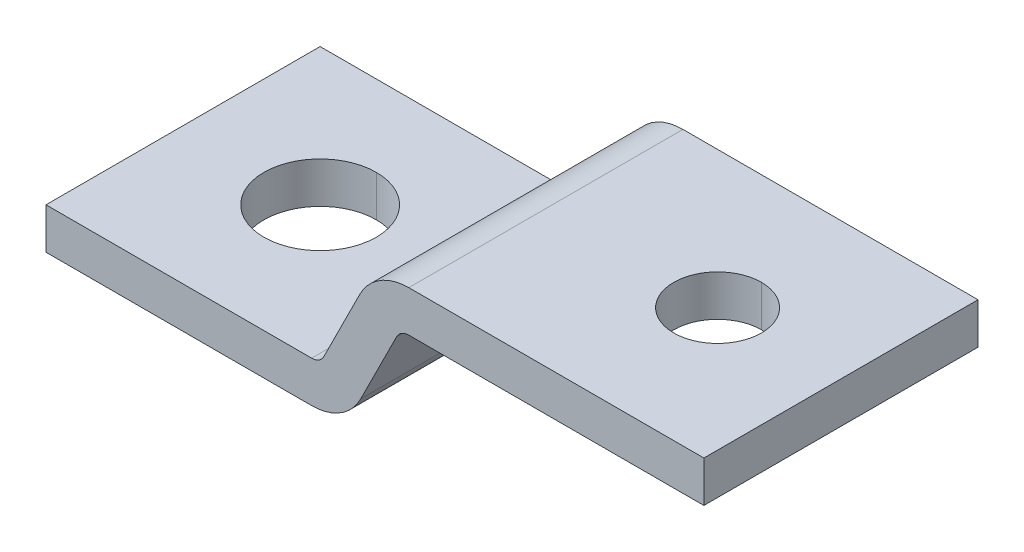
ISO-10303-21;
HEADER;
FILE_DESCRIPTION(('STEP AP214'),'2;1');
FILE_NAME('part.step','',(''),(''),'','','');
FILE_SCHEMA(('AUTOMOTIVE_DESIGN { 1 0 10303 214 1 1 1 1 }'));
ENDSEC;
DATA;
#1=APPLICATION_CONTEXT('core data for automotive mechanical design processes');
#2=APPLICATION_PROTOCOL_DEFINITION('international standard','automotive_design',2000,#1);
#3=PRODUCT_CONTEXT('',#1,'mechanical');
#4=PRODUCT('Part','Part','',(#3));
#5=PRODUCT_RELATED_PRODUCT_CATEGORY('part','',(#4));
#6=PRODUCT_DEFINITION_FORMATION('','',#4);
#7=PRODUCT_DEFINITION_CONTEXT('part definition',#1,'design');
#8=PRODUCT_DEFINITION('design','',#6,#7);
#9=PRODUCT_DEFINITION_SHAPE('','',#8);
#10=(LENGTH_UNIT() NAMED_UNIT(*) SI_UNIT(.MILLI.,.METRE.));
#11=(NAMED_UNIT(*) PLANE_ANGLE_UNIT() SI_UNIT($,.RADIAN.));
#12=(NAMED_UNIT(*) SI_UNIT($,.STERADIAN.) SOLID_ANGLE_UNIT());
#13=UNCERTAINTY_MEASURE_WITH_UNIT(LENGTH_MEASURE(1.E-05),#10,'distance_accuracy_value','');
#14=(GEOMETRIC_REPRESENTATION_CONTEXT(3) GLOBAL_UNCERTAINTY_ASSIGNED_CONTEXT((#13)) GLOBAL_UNIT_ASSIGNED_CONTEXT((#10,
#11,#12)) REPRESENTATION_CONTEXT('',''));
#15=CARTESIAN_POINT('',(0.,0.,0.));
#16=DIRECTION('',(0.,0.,1.));
#17=DIRECTION('',(1.,0.,0.));
#18=AXIS2_PLACEMENT_3D('',#15,#16,#17);
#19=CARTESIAN_POINT('',(2.89110178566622,9.61717338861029,17.2699844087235));
#20=DIRECTION('',(0.,1.,0.));
#21=DIRECTION('',(0.,0.,1.));
#22=AXIS2_PLACEMENT_3D('',#19,#20,#21);
#23=CYLINDRICAL_SURFACE('',#22,2.05);
#24=DIRECTION('',(0.,1.,0.));
#25=VECTOR('',#24,1.);
#26=CARTESIAN_POINT('',(2.89110178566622,9.61717338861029,15.2199844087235));
#27=LINE('',#26,#25);
#28=CARTESIAN_POINT('',(2.89110178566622,9.7171733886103,15.2199844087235));
#29=VERTEX_POINT('',#28);
#30=CARTESIAN_POINT('',(2.89110178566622,11.2171733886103,15.2199844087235));
#31=VERTEX_POINT('',#30);
#32=EDGE_CURVE('E333',#29,#31,#27,.T.);
#33=ORIENTED_EDGE('',*,*,#32,.F.);
#34=CARTESIAN_POINT('',(2.89110178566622,9.7171733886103,17.2699844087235));
#35=DIRECTION('',(0.,-1.,0.));
#36=DIRECTION('',(0.,0.,-1.));
#37=AXIS2_PLACEMENT_3D('',#34,#35,#36);
#38=CIRCLE('',#37,2.05);
#39=CARTESIAN_POINT('',(2.89110178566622,9.7171733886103,19.3199844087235));
#40=VERTEX_POINT('',#39);
#41=EDGE_CURVE('E252',#29,#40,#38,.T.);
#42=ORIENTED_EDGE('',*,*,#41,.T.);
#43=DIRECTION('',(0.,1.,0.));
#44=VECTOR('',#43,1.);
#45=CARTESIAN_POINT('',(2.89110178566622,9.61717338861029,19.3199844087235));
#46=LINE('',#45,#44);
#47=CARTESIAN_POINT('',(2.89110178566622,11.2171733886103,19.3199844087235));
#48=VERTEX_POINT('',#47);
#49=EDGE_CURVE('E198',#40,#48,#46,.T.);
#50=ORIENTED_EDGE('',*,*,#49,.T.);
#51=CARTESIAN_POINT('',(2.89110178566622,11.2171733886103,17.2699844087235));
#52=DIRECTION('',(0.,1.,0.));
#53=DIRECTION('',(0.,0.,1.));
#54=AXIS2_PLACEMENT_3D('',#51,#52,#53);
#55=CIRCLE('',#54,2.05);
#56=EDGE_CURVE('E278',#48,#31,#55,.T.);
#57=ORIENTED_EDGE('',*,*,#56,.T.);
#58=EDGE_LOOP('',(#33,#42,#50,#57));
#59=FACE_BOUND('',#58,.T.);
#60=ADVANCED_FACE('F15',(#59),#23,.F.);
#61=CARTESIAN_POINT('',(17.3911017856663,13.6171733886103,17.2699844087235));
#62=DIRECTION('',(0.,1.,0.));
#63=DIRECTION('',(0.,0.,1.));
#64=AXIS2_PLACEMENT_3D('',#61,#62,#63);
#65=CYLINDRICAL_SURFACE('',#64,1.6);
#66=DIRECTION('',(0.,1.,0.));
#67=VECTOR('',#66,1.);
#68=CARTESIAN_POINT('',(17.3911017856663,13.6171733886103,15.6699844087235));
#69=LINE('',#68,#67);
#70=CARTESIAN_POINT('',(17.3911017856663,13.7171733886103,15.6699844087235));
#71=VERTEX_POINT('',#70);
#72=CARTESIAN_POINT('',(17.3911017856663,15.2171733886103,15.6699844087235));
#73=VERTEX_POINT('',#72);
#74=EDGE_CURVE('E174',#71,#73,#69,.T.);
#75=ORIENTED_EDGE('',*,*,#74,.F.);
#76=CARTESIAN_POINT('',(17.3911017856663,13.7171733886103,17.2699844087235));
#77=DIRECTION('',(0.,-1.,0.));
#78=DIRECTION('',(0.,0.,-1.));
#79=AXIS2_PLACEMENT_3D('',#76,#77,#78);
#80=CIRCLE('',#79,1.6);
#81=CARTESIAN_POINT('',(17.3911017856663,13.7171733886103,18.8699844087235));
#82=VERTEX_POINT('',#81);
#83=EDGE_CURVE('E224',#71,#82,#80,.T.);
#84=ORIENTED_EDGE('',*,*,#83,.T.);
#85=DIRECTION('',(0.,1.,0.));
#86=VECTOR('',#85,1.);
#87=CARTESIAN_POINT('',(17.3911017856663,13.6171733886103,18.8699844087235));
#88=LINE('',#87,#86);
#89=CARTESIAN_POINT('',(17.3911017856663,15.2171733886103,18.8699844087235));
#90=VERTEX_POINT('',#89);
#91=EDGE_CURVE('E177',#82,#90,#88,.T.);
#92=ORIENTED_EDGE('',*,*,#91,.T.);
#93=CARTESIAN_POINT('',(17.3911017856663,15.2171733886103,17.2699844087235));
#94=DIRECTION('',(0.,1.,0.));
#95=DIRECTION('',(0.,0.,1.));
#96=AXIS2_PLACEMENT_3D('',#93,#94,#95);
#97=CIRCLE('',#96,1.6);
#98=EDGE_CURVE('E170',#90,#73,#97,.T.);
#99=ORIENTED_EDGE('',*,*,#98,.T.);
#100=EDGE_LOOP('',(#75,#84,#92,#99));
#101=FACE_BOUND('',#100,.T.);
#102=ADVANCED_FACE('F172',(#101),#65,.F.);
#103=CARTESIAN_POINT('',(11.127169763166,13.2171733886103,12.2699844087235));
#104=DIRECTION('',(0.,0.,1.));
#105=DIRECTION('',(1.,0.,0.));
#106=AXIS2_PLACEMENT_3D('',#103,#104,#105);
#107=CYLINDRICAL_SURFACE('',#106,2.);
#108=CARTESIAN_POINT('',(11.127169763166,13.2171733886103,12.2699844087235));
#109=DIRECTION('',(0.,0.,-1.));
#110=DIRECTION('',(-1.,0.,0.));
#111=AXIS2_PLACEMENT_3D('',#108,#109,#110);
#112=CIRCLE('',#111,2.);
#113=CARTESIAN_POINT('',(9.33831538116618,14.1116005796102,12.2699844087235));
#114=VERTEX_POINT('',#113);
#115=CARTESIAN_POINT('',(11.127169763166,15.2171733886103,12.2699844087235));
#116=VERTEX_POINT('',#115);
#117=EDGE_CURVE('E292',#114,#116,#112,.T.);
#118=ORIENTED_EDGE('',*,*,#117,.F.);
#119=DIRECTION('',(0.,0.,-1.));
#120=VECTOR('',#119,1.);
#121=CARTESIAN_POINT('',(9.33831538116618,14.1116005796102,12.2699844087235));
#122=LINE('',#121,#120);
#123=CARTESIAN_POINT('',(9.33831538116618,14.1116005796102,22.2699844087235));
#124=VERTEX_POINT('',#123);
#125=EDGE_CURVE('E315',#124,#114,#122,.T.);
#126=ORIENTED_EDGE('',*,*,#125,.F.);
#127=CARTESIAN_POINT('',(11.127169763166,13.2171733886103,22.2699844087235));
#128=DIRECTION('',(0.,0.,1.));
#129=DIRECTION('',(-1.,0.,0.));
#130=AXIS2_PLACEMENT_3D('',#127,#128,#129);
#131=CIRCLE('',#130,2.);
#132=CARTESIAN_POINT('',(11.127169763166,15.2171733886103,22.2699844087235));
#133=VERTEX_POINT('',#132);
#134=EDGE_CURVE('E18',#133,#124,#131,.T.);
#135=ORIENTED_EDGE('',*,*,#134,.F.);
#136=DIRECTION('',(0.,0.,1.));
#137=VECTOR('',#136,1.);
#138=CARTESIAN_POINT('',(11.127169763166,15.2171733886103,12.2699844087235));
#139=LINE('',#138,#137);
#140=EDGE_CURVE('E202',#116,#133,#139,.T.);
#141=ORIENTED_EDGE('',*,*,#140,.F.);
#142=EDGE_LOOP('',(#118,#126,#135,#141));
#143=FACE_BOUND('',#142,.T.);
#144=ADVANCED_FACE('F316',(#143),#107,.T.);
#145=CARTESIAN_POINT('',(7.58208479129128,11.7171733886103,12.2699844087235));
#146=DIRECTION('',(0.,0.,1.));
#147=DIRECTION('',(1.,0.,0.));
#148=AXIS2_PLACEMENT_3D('',#145,#146,#147);
#149=CYLINDRICAL_SURFACE('',#148,2.);
#150=CARTESIAN_POINT('',(7.58208479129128,11.7171733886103,12.2699844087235));
#151=DIRECTION('',(0.,0.,-1.));
#152=DIRECTION('',(-1.,0.,0.));
#153=AXIS2_PLACEMENT_3D('',#150,#151,#152);
#154=CIRCLE('',#153,2.);
#155=CARTESIAN_POINT('',(9.37093917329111,10.8227461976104,12.2699844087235));
#156=VERTEX_POINT('',#155);
#157=CARTESIAN_POINT('',(7.58208479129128,9.7171733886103,12.2699844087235));
#158=VERTEX_POINT('',#157);
#159=EDGE_CURVE('E287',#156,#158,#154,.T.);
#160=ORIENTED_EDGE('',*,*,#159,.F.);
#161=DIRECTION('',(0.,0.,-1.));
#162=VECTOR('',#161,1.);
#163=CARTESIAN_POINT('',(9.37093917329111,10.8227461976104,12.2699844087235));
#164=LINE('',#163,#162);
#165=CARTESIAN_POINT('',(9.37093917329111,10.8227461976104,22.2699844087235));
#166=VERTEX_POINT('',#165);
#167=EDGE_CURVE('E206',#166,#156,#164,.T.);
#168=ORIENTED_EDGE('',*,*,#167,.F.);
#169=CARTESIAN_POINT('',(7.58208479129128,11.7171733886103,22.2699844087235));
#170=DIRECTION('',(0.,0.,1.));
#171=DIRECTION('',(-1.,0.,0.));
#172=AXIS2_PLACEMENT_3D('',#169,#170,#171);
#173=CIRCLE('',#172,2.);
#174=CARTESIAN_POINT('',(7.58208479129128,9.7171733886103,22.2699844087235));
#175=VERTEX_POINT('',#174);
#176=EDGE_CURVE('E298',#175,#166,#173,.T.);
#177=ORIENTED_EDGE('',*,*,#176,.F.);
#178=DIRECTION('',(0.,0.,1.));
#179=VECTOR('',#178,1.);
#180=CARTESIAN_POINT('',(7.58208479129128,9.7171733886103,12.2699844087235));
#181=LINE('',#180,#179);
#182=EDGE_CURVE('E240',#158,#175,#181,.T.);
#183=ORIENTED_EDGE('',*,*,#182,.F.);
#184=EDGE_LOOP('',(#160,#168,#177,#183));
#185=FACE_BOUND('',#184,.T.);
#186=ADVANCED_FACE('F383',(#185),#149,.T.);
#187=CARTESIAN_POINT('',(7.58208479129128,11.7171733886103,12.2699844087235));
#188=DIRECTION('',(0.,0.,-1.));
#189=DIRECTION('',(-1.,0.,0.));
#190=AXIS2_PLACEMENT_3D('',#187,#188,#189);
#191=CYLINDRICAL_SURFACE('',#190,0.5);
#192=CARTESIAN_POINT('',(7.58208479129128,11.7171733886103,12.2699844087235));
#193=DIRECTION('',(0.,0.,1.));
#194=DIRECTION('',(-1.,0.,0.));
#195=AXIS2_PLACEMENT_3D('',#192,#193,#194);
#196=CIRCLE('',#195,0.5);
#197=CARTESIAN_POINT('',(7.58208479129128,11.2171733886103,12.2699844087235));
#198=VERTEX_POINT('',#197);
#199=CARTESIAN_POINT('',(8.02929838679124,11.4935665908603,12.2699844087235));
#200=VERTEX_POINT('',#199);
#201=EDGE_CURVE('E107',#198,#200,#196,.T.);
#202=ORIENTED_EDGE('',*,*,#201,.F.);
#203=DIRECTION('',(0.,0.,-1.));
#204=VECTOR('',#203,1.);
#205=CARTESIAN_POINT('',(7.58208479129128,11.2171733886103,12.2699844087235));
#206=LINE('',#205,#204);
#207=CARTESIAN_POINT('',(7.58208479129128,11.2171733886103,22.2699844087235));
#208=VERTEX_POINT('',#207);
#209=EDGE_CURVE('E271',#208,#198,#206,.T.);
#210=ORIENTED_EDGE('',*,*,#209,.F.);
#211=CARTESIAN_POINT('',(7.58208479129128,11.7171733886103,22.2699844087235));
#212=DIRECTION('',(0.,0.,-1.));
#213=DIRECTION('',(-1.,0.,0.));
#214=AXIS2_PLACEMENT_3D('',#211,#212,#213);
#215=CIRCLE('',#214,0.5);
#216=CARTESIAN_POINT('',(8.02929838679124,11.4935665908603,22.2699844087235));
#217=VERTEX_POINT('',#216);
#218=EDGE_CURVE('E10',#217,#208,#215,.T.);
#219=ORIENTED_EDGE('',*,*,#218,.F.);
#220=DIRECTION('',(0.,0.,1.));
#221=VECTOR('',#220,1.);
#222=CARTESIAN_POINT('',(8.02929838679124,11.4935665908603,22.2699844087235));
#223=LINE('',#222,#221);
#224=EDGE_CURVE('E324',#200,#217,#223,.T.);
#225=ORIENTED_EDGE('',*,*,#224,.F.);
#226=EDGE_LOOP('',(#202,#210,#219,#225));
#227=FACE_BOUND('',#226,.T.);
#228=ADVANCED_FACE('F393',(#227),#191,.F.);
#229=CARTESIAN_POINT('',(11.127169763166,13.2171733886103,12.2699844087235));
#230=DIRECTION('',(0.,0.,-1.));
#231=DIRECTION('',(-1.,0.,0.));
#232=AXIS2_PLACEMENT_3D('',#229,#230,#231);
#233=CYLINDRICAL_SURFACE('',#232,0.5);
#234=CARTESIAN_POINT('',(11.127169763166,13.2171733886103,12.2699844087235));
#235=DIRECTION('',(0.,0.,1.));
#236=DIRECTION('',(-1.,0.,0.));
#237=AXIS2_PLACEMENT_3D('',#234,#235,#236);
#238=CIRCLE('',#237,0.5);
#239=CARTESIAN_POINT('',(11.127169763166,13.7171733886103,12.2699844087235));
#240=VERTEX_POINT('',#239);
#241=CARTESIAN_POINT('',(10.6799561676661,13.4407801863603,12.2699844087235));
#242=VERTEX_POINT('',#241);
#243=EDGE_CURVE('E295',#240,#242,#238,.T.);
#244=ORIENTED_EDGE('',*,*,#243,.F.);
#245=DIRECTION('',(0.,0.,-1.));
#246=VECTOR('',#245,1.);
#247=CARTESIAN_POINT('',(11.127169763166,13.7171733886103,12.2699844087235));
#248=LINE('',#247,#246);
#249=CARTESIAN_POINT('',(11.127169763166,13.7171733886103,22.2699844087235));
#250=VERTEX_POINT('',#249);
#251=EDGE_CURVE('E219',#250,#240,#248,.T.);
#252=ORIENTED_EDGE('',*,*,#251,.F.);
#253=CARTESIAN_POINT('',(11.127169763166,13.2171733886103,22.2699844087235));
#254=DIRECTION('',(0.,0.,-1.));
#255=DIRECTION('',(-1.,0.,0.));
#256=AXIS2_PLACEMENT_3D('',#253,#254,#255);
#257=CIRCLE('',#256,0.5);
#258=CARTESIAN_POINT('',(10.6799561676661,13.4407801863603,22.2699844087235));
#259=VERTEX_POINT('',#258);
#260=EDGE_CURVE('E300',#259,#250,#257,.T.);
#261=ORIENTED_EDGE('',*,*,#260,.F.);
#262=DIRECTION('',(0.,0.,1.));
#263=VECTOR('',#262,1.);
#264=CARTESIAN_POINT('',(10.6799561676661,13.4407801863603,22.2699844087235));
#265=LINE('',#264,#263);
#266=EDGE_CURVE('E231',#242,#259,#265,.T.);
#267=ORIENTED_EDGE('',*,*,#266,.F.);
#268=EDGE_LOOP('',(#244,#252,#261,#267));
#269=FACE_BOUND('',#268,.T.);
#270=ADVANCED_FACE('F375',(#269),#233,.F.);
#271=CARTESIAN_POINT('',(21.8911017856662,13.7171733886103,22.2699844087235));
#272=DIRECTION('',(0.,0.,-1.));
#273=DIRECTION('',(0.,-1.,0.));
#274=AXIS2_PLACEMENT_3D('',#271,#272,#273);
#275=PLANE('',#274);
#276=DIRECTION('',(1.,0.,0.));
#277=VECTOR('',#276,1.);
#278=CARTESIAN_POINT('',(-2.10889821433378,9.7171733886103,22.2699844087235));
#279=LINE('',#278,#277);
#280=CARTESIAN_POINT('',(-2.10889821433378,9.7171733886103,22.2699844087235));
#281=VERTEX_POINT('',#280);
#282=EDGE_CURVE('E244',#281,#175,#279,.T.);
#283=ORIENTED_EDGE('',*,*,#282,.T.);
#284=ORIENTED_EDGE('',*,*,#176,.T.);
#285=DIRECTION('',(0.447213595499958,0.894427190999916,0.));
#286=VECTOR('',#285,1.);
#287=CARTESIAN_POINT('',(9.2327425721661,10.5463529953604,22.2699844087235));
#288=LINE('',#287,#286);
#289=EDGE_CURVE('E211',#166,#259,#288,.T.);
#290=ORIENTED_EDGE('',*,*,#289,.T.);
#291=ORIENTED_EDGE('',*,*,#260,.T.);
#292=DIRECTION('',(1.,0.,0.));
#293=VECTOR('',#292,1.);
#294=CARTESIAN_POINT('',(9.89110178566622,13.7171733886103,22.2699844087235));
#295=LINE('',#294,#293);
#296=CARTESIAN_POINT('',(21.8911017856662,13.7171733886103,22.2699844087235));
#297=VERTEX_POINT('',#296);
#298=EDGE_CURVE('E216',#250,#297,#295,.T.);
#299=ORIENTED_EDGE('',*,*,#298,.T.);
#300=DIRECTION('',(0.,-1.,0.));
#301=VECTOR('',#300,1.);
#302=CARTESIAN_POINT('',(21.8911017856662,15.2171733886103,22.2699844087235));
#303=LINE('',#302,#301);
#304=CARTESIAN_POINT('',(21.8911017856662,15.2171733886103,22.2699844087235));
#305=VERTEX_POINT('',#304);
#306=EDGE_CURVE('E38',#305,#297,#303,.T.);
#307=ORIENTED_EDGE('',*,*,#306,.F.);
#308=DIRECTION('',(1.,0.,0.));
#309=VECTOR('',#308,1.);
#310=CARTESIAN_POINT('',(9.89110178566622,15.2171733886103,22.2699844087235));
#311=LINE('',#310,#309);
#312=EDGE_CURVE('E203',#133,#305,#311,.T.);
#313=ORIENTED_EDGE('',*,*,#312,.F.);
#314=ORIENTED_EDGE('',*,*,#134,.T.);
#315=DIRECTION('',(0.447213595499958,0.894427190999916,0.));
#316=VECTOR('',#315,1.);
#317=CARTESIAN_POINT('',(7.89110178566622,11.2171733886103,22.2699844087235));
#318=LINE('',#317,#316);
#319=EDGE_CURVE('E280',#217,#124,#318,.T.);
#320=ORIENTED_EDGE('',*,*,#319,.F.);
#321=ORIENTED_EDGE('',*,*,#218,.T.);
#322=DIRECTION('',(1.,0.,0.));
#323=VECTOR('',#322,1.);
#324=CARTESIAN_POINT('',(-2.10889821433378,11.2171733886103,22.2699844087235));
#325=LINE('',#324,#323);
#326=CARTESIAN_POINT('',(-2.10889821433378,11.2171733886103,22.2699844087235));
#327=VERTEX_POINT('',#326);
#328=EDGE_CURVE('E267',#327,#208,#325,.T.);
#329=ORIENTED_EDGE('',*,*,#328,.F.);
#330=DIRECTION('',(0.,1.,0.));
#331=VECTOR('',#330,1.);
#332=CARTESIAN_POINT('',(-2.10889821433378,9.7171733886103,22.2699844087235));
#333=LINE('',#332,#331);
#334=EDGE_CURVE('E255',#281,#327,#333,.T.);
#335=ORIENTED_EDGE('',*,*,#334,.F.);
#336=EDGE_LOOP('',(#283,#284,#290,#291,#299,#307,#313,#314,#320,#321,#329,#335));
#337=FACE_BOUND('',#336,.T.);
#338=ADVANCED_FACE('F309',(#337),#275,.F.);
#339=CARTESIAN_POINT('',(21.8911017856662,13.7171733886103,12.2699844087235));
#340=DIRECTION('',(0.,0.,-1.));
#341=DIRECTION('',(0.,-1.,0.));
#342=AXIS2_PLACEMENT_3D('',#339,#340,#341);
#343=PLANE('',#342);
#344=DIRECTION('',(0.447213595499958,0.894427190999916,0.));
#345=VECTOR('',#344,1.);
#346=CARTESIAN_POINT('',(9.2327425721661,10.5463529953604,12.2699844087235));
#347=LINE('',#346,#345);
#348=EDGE_CURVE('E210',#156,#242,#347,.T.);
#349=ORIENTED_EDGE('',*,*,#348,.F.);
#350=ORIENTED_EDGE('',*,*,#159,.T.);
#351=DIRECTION('',(1.,0.,0.));
#352=VECTOR('',#351,1.);
#353=CARTESIAN_POINT('',(-2.10889821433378,9.7171733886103,12.2699844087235));
#354=LINE('',#353,#352);
#355=CARTESIAN_POINT('',(-2.10889821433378,9.7171733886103,12.2699844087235));
#356=VERTEX_POINT('',#355);
#357=EDGE_CURVE('E236',#356,#158,#354,.T.);
#358=ORIENTED_EDGE('',*,*,#357,.F.);
#359=DIRECTION('',(0.,1.,0.));
#360=VECTOR('',#359,1.);
#361=CARTESIAN_POINT('',(-2.10889821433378,9.7171733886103,12.2699844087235));
#362=LINE('',#361,#360);
#363=CARTESIAN_POINT('',(-2.10889821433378,11.2171733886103,12.2699844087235));
#364=VERTEX_POINT('',#363);
#365=EDGE_CURVE('E263',#356,#364,#362,.T.);
#366=ORIENTED_EDGE('',*,*,#365,.T.);
#367=DIRECTION('',(1.,0.,0.));
#368=VECTOR('',#367,1.);
#369=CARTESIAN_POINT('',(-2.10889821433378,11.2171733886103,12.2699844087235));
#370=LINE('',#369,#368);
#371=EDGE_CURVE('E275',#364,#198,#370,.T.);
#372=ORIENTED_EDGE('',*,*,#371,.T.);
#373=ORIENTED_EDGE('',*,*,#201,.T.);
#374=DIRECTION('',(0.447213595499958,0.894427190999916,0.));
#375=VECTOR('',#374,1.);
#376=CARTESIAN_POINT('',(7.89110178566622,11.2171733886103,12.2699844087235));
#377=LINE('',#376,#375);
#378=EDGE_CURVE('E321',#200,#114,#377,.T.);
#379=ORIENTED_EDGE('',*,*,#378,.T.);
#380=ORIENTED_EDGE('',*,*,#117,.T.);
#381=DIRECTION('',(1.,0.,0.));
#382=VECTOR('',#381,1.);
#383=CARTESIAN_POINT('',(9.89110178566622,15.2171733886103,12.2699844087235));
#384=LINE('',#383,#382);
#385=CARTESIAN_POINT('',(21.8911017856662,15.2171733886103,12.2699844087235));
#386=VERTEX_POINT('',#385);
#387=EDGE_CURVE('E353',#116,#386,#384,.T.);
#388=ORIENTED_EDGE('',*,*,#387,.T.);
#389=DIRECTION('',(0.,-1.,0.));
#390=VECTOR('',#389,1.);
#391=CARTESIAN_POINT('',(21.8911017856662,15.2171733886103,12.2699844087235));
#392=LINE('',#391,#390);
#393=CARTESIAN_POINT('',(21.8911017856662,13.7171733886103,12.2699844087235));
#394=VERTEX_POINT('',#393);
#395=EDGE_CURVE('E284',#386,#394,#392,.T.);
#396=ORIENTED_EDGE('',*,*,#395,.T.);
#397=DIRECTION('',(1.,0.,0.));
#398=VECTOR('',#397,1.);
#399=CARTESIAN_POINT('',(9.89110178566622,13.7171733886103,12.2699844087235));
#400=LINE('',#399,#398);
#401=EDGE_CURVE('E225',#240,#394,#400,.T.);
#402=ORIENTED_EDGE('',*,*,#401,.F.);
#403=ORIENTED_EDGE('',*,*,#243,.T.);
#404=EDGE_LOOP('',(#349,#350,#358,#366,#372,#373,#379,#380,#388,#396,#402,#403));
#405=FACE_BOUND('',#404,.T.);
#406=ADVANCED_FACE('F369',(#405),#343,.T.);
#407=CARTESIAN_POINT('',(21.8911017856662,15.2171733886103,12.2699844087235));
#408=DIRECTION('',(-1.,0.,0.));
#409=DIRECTION('',(0.,0.,1.));
#410=AXIS2_PLACEMENT_3D('',#407,#408,#409);
#411=PLANE('',#410);
#412=DIRECTION('',(0.,0.,1.));
#413=VECTOR('',#412,1.);
#414=CARTESIAN_POINT('',(21.8911017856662,15.2171733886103,12.2699844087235));
#415=LINE('',#414,#413);
#416=EDGE_CURVE('E181',#386,#305,#415,.T.);
#417=ORIENTED_EDGE('',*,*,#416,.T.);
#418=ORIENTED_EDGE('',*,*,#306,.T.);
#419=DIRECTION('',(0.,0.,1.));
#420=VECTOR('',#419,1.);
#421=CARTESIAN_POINT('',(21.8911017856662,13.7171733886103,12.2699844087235));
#422=LINE('',#421,#420);
#423=EDGE_CURVE('E220',#394,#297,#422,.T.);
#424=ORIENTED_EDGE('',*,*,#423,.F.);
#425=ORIENTED_EDGE('',*,*,#395,.F.);
#426=EDGE_LOOP('',(#417,#418,#424,#425));
#427=FACE_BOUND('',#426,.T.);
#428=ADVANCED_FACE('F365',(#427),#411,.F.);
#429=CARTESIAN_POINT('',(9.89110178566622,15.2171733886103,12.2699844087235));
#430=DIRECTION('',(0.,-1.,0.));
#431=DIRECTION('',(0.,0.,-1.));
#432=AXIS2_PLACEMENT_3D('',#429,#430,#431);
#433=PLANE('',#432);
#434=ORIENTED_EDGE('',*,*,#98,.F.);
#435=CARTESIAN_POINT('',(17.3911017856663,15.2171733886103,17.2699844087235));
#436=DIRECTION('',(0.,1.,0.));
#437=DIRECTION('',(0.,0.,1.));
#438=AXIS2_PLACEMENT_3D('',#435,#436,#437);
#439=CIRCLE('',#438,1.6);
#440=EDGE_CURVE('E183',#73,#90,#439,.T.);
#441=ORIENTED_EDGE('',*,*,#440,.F.);
#442=EDGE_LOOP('',(#434,#441));
#443=FACE_BOUND('',#442,.T.);
#444=ORIENTED_EDGE('',*,*,#387,.F.);
#445=ORIENTED_EDGE('',*,*,#140,.T.);
#446=ORIENTED_EDGE('',*,*,#312,.T.);
#447=ORIENTED_EDGE('',*,*,#416,.F.);
#448=EDGE_LOOP('',(#444,#445,#446,#447));
#449=FACE_BOUND('',#448,.T.);
#450=ADVANCED_FACE('F184',(#443,#449),#433,.F.);
#451=CARTESIAN_POINT('',(7.89110178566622,11.2171733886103,12.2699844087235));
#452=DIRECTION('',(0.894427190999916,-0.447213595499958,0.));
#453=DIRECTION('',(0.,0.,-1.));
#454=AXIS2_PLACEMENT_3D('',#451,#452,#453);
#455=PLANE('',#454);
#456=ORIENTED_EDGE('',*,*,#319,.T.);
#457=ORIENTED_EDGE('',*,*,#125,.T.);
#458=ORIENTED_EDGE('',*,*,#378,.F.);
#459=ORIENTED_EDGE('',*,*,#224,.T.);
#460=EDGE_LOOP('',(#456,#457,#458,#459));
#461=FACE_BOUND('',#460,.T.);
#462=ADVANCED_FACE('F323',(#461),#455,.F.);
#463=CARTESIAN_POINT('',(-2.10889821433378,11.2171733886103,12.2699844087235));
#464=DIRECTION('',(0.,-1.,0.));
#465=DIRECTION('',(0.,0.,-1.));
#466=AXIS2_PLACEMENT_3D('',#463,#464,#465);
#467=PLANE('',#466);
#468=ORIENTED_EDGE('',*,*,#56,.F.);
#469=CARTESIAN_POINT('',(2.89110178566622,11.2171733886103,17.2699844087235));
#470=DIRECTION('',(0.,1.,0.));
#471=DIRECTION('',(0.,0.,1.));
#472=AXIS2_PLACEMENT_3D('',#469,#470,#471);
#473=CIRCLE('',#472,2.05);
#474=EDGE_CURVE('E339',#31,#48,#473,.T.);
#475=ORIENTED_EDGE('',*,*,#474,.F.);
#476=EDGE_LOOP('',(#468,#475));
#477=FACE_BOUND('',#476,.T.);
#478=ORIENTED_EDGE('',*,*,#328,.T.);
#479=ORIENTED_EDGE('',*,*,#209,.T.);
#480=ORIENTED_EDGE('',*,*,#371,.F.);
#481=DIRECTION('',(0.,0.,1.));
#482=VECTOR('',#481,1.);
#483=CARTESIAN_POINT('',(-2.10889821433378,11.2171733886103,12.2699844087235));
#484=LINE('',#483,#482);
#485=EDGE_CURVE('E259',#364,#327,#484,.T.);
#486=ORIENTED_EDGE('',*,*,#485,.T.);
#487=EDGE_LOOP('',(#478,#479,#480,#486));
#488=FACE_BOUND('',#487,.T.);
#489=ADVANCED_FACE('F392',(#477,#488),#467,.F.);
#490=CARTESIAN_POINT('',(-2.10889821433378,9.7171733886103,12.2699844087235));
#491=DIRECTION('',(1.,0.,0.));
#492=DIRECTION('',(0.,1.,0.));
#493=AXIS2_PLACEMENT_3D('',#490,#491,#492);
#494=PLANE('',#493);
#495=DIRECTION('',(0.,0.,1.));
#496=VECTOR('',#495,1.);
#497=CARTESIAN_POINT('',(-2.10889821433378,9.7171733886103,12.2699844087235));
#498=LINE('',#497,#496);
#499=EDGE_CURVE('E248',#356,#281,#498,.T.);
#500=ORIENTED_EDGE('',*,*,#499,.T.);
#501=ORIENTED_EDGE('',*,*,#334,.T.);
#502=ORIENTED_EDGE('',*,*,#485,.F.);
#503=ORIENTED_EDGE('',*,*,#365,.F.);
#504=EDGE_LOOP('',(#500,#501,#502,#503));
#505=FACE_BOUND('',#504,.T.);
#506=ADVANCED_FACE('F389',(#505),#494,.F.);
#507=CARTESIAN_POINT('',(-2.10889821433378,9.7171733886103,12.2699844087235));
#508=DIRECTION('',(0.,-1.,0.));
#509=DIRECTION('',(0.,0.,-1.));
#510=AXIS2_PLACEMENT_3D('',#507,#508,#509);
#511=PLANE('',#510);
#512=CARTESIAN_POINT('',(2.89110178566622,9.7171733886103,17.2699844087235));
#513=DIRECTION('',(0.,-1.,0.));
#514=DIRECTION('',(0.,0.,-1.));
#515=AXIS2_PLACEMENT_3D('',#512,#513,#514);
#516=CIRCLE('',#515,2.05);
#517=EDGE_CURVE('E330',#40,#29,#516,.T.);
#518=ORIENTED_EDGE('',*,*,#517,.F.);
#519=ORIENTED_EDGE('',*,*,#41,.F.);
#520=EDGE_LOOP('',(#518,#519));
#521=FACE_BOUND('',#520,.T.);
#522=ORIENTED_EDGE('',*,*,#357,.T.);
#523=ORIENTED_EDGE('',*,*,#182,.T.);
#524=ORIENTED_EDGE('',*,*,#282,.F.);
#525=ORIENTED_EDGE('',*,*,#499,.F.);
#526=EDGE_LOOP('',(#522,#523,#524,#525));
#527=FACE_BOUND('',#526,.T.);
#528=ADVANCED_FACE('F387',(#521,#527),#511,.T.);
#529=CARTESIAN_POINT('',(9.2327425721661,10.5463529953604,12.2699844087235));
#530=DIRECTION('',(0.894427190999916,-0.447213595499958,0.));
#531=DIRECTION('',(0.,0.,-1.));
#532=AXIS2_PLACEMENT_3D('',#529,#530,#531);
#533=PLANE('',#532);
#534=ORIENTED_EDGE('',*,*,#289,.F.);
#535=ORIENTED_EDGE('',*,*,#167,.T.);
#536=ORIENTED_EDGE('',*,*,#348,.T.);
#537=ORIENTED_EDGE('',*,*,#266,.T.);
#538=EDGE_LOOP('',(#534,#535,#536,#537));
#539=FACE_BOUND('',#538,.T.);
#540=ADVANCED_FACE('F378',(#539),#533,.T.);
#541=CARTESIAN_POINT('',(9.89110178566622,13.7171733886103,12.2699844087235));
#542=DIRECTION('',(0.,-1.,0.));
#543=DIRECTION('',(0.,0.,-1.));
#544=AXIS2_PLACEMENT_3D('',#541,#542,#543);
#545=PLANE('',#544);
#546=CARTESIAN_POINT('',(17.3911017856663,13.7171733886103,17.2699844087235));
#547=DIRECTION('',(0.,-1.,0.));
#548=DIRECTION('',(0.,0.,-1.));
#549=AXIS2_PLACEMENT_3D('',#546,#547,#548);
#550=CIRCLE('',#549,1.6);
#551=EDGE_CURVE('E191',#82,#71,#550,.T.);
#552=ORIENTED_EDGE('',*,*,#551,.F.);
#553=ORIENTED_EDGE('',*,*,#83,.F.);
#554=EDGE_LOOP('',(#552,#553));
#555=FACE_BOUND('',#554,.T.);
#556=ORIENTED_EDGE('',*,*,#298,.F.);
#557=ORIENTED_EDGE('',*,*,#251,.T.);
#558=ORIENTED_EDGE('',*,*,#401,.T.);
#559=ORIENTED_EDGE('',*,*,#423,.T.);
#560=EDGE_LOOP('',(#556,#557,#558,#559));
#561=FACE_BOUND('',#560,.T.);
#562=ADVANCED_FACE('F373',(#555,#561),#545,.T.);
#563=CARTESIAN_POINT('',(17.3911017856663,13.6171733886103,17.2699844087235));
#564=DIRECTION('',(0.,1.,0.));
#565=DIRECTION('',(0.,0.,1.));
#566=AXIS2_PLACEMENT_3D('',#563,#564,#565);
#567=CYLINDRICAL_SURFACE('',#566,1.6);
#568=ORIENTED_EDGE('',*,*,#551,.T.);
#569=ORIENTED_EDGE('',*,*,#74,.T.);
#570=ORIENTED_EDGE('',*,*,#440,.T.);
#571=ORIENTED_EDGE('',*,*,#91,.F.);
#572=EDGE_LOOP('',(#568,#569,#570,#571));
#573=FACE_BOUND('',#572,.T.);
#574=ADVANCED_FACE('F189',(#573),#567,.F.);
#575=CARTESIAN_POINT('',(2.89110178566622,9.61717338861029,17.2699844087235));
#576=DIRECTION('',(0.,1.,0.));
#577=DIRECTION('',(0.,0.,1.));
#578=AXIS2_PLACEMENT_3D('',#575,#576,#577);
#579=CYLINDRICAL_SURFACE('',#578,2.05);
#580=ORIENTED_EDGE('',*,*,#517,.T.);
#581=ORIENTED_EDGE('',*,*,#32,.T.);
#582=ORIENTED_EDGE('',*,*,#474,.T.);
#583=ORIENTED_EDGE('',*,*,#49,.F.);
#584=EDGE_LOOP('',(#580,#581,#582,#583));
#585=FACE_BOUND('',#584,.T.);
#586=ADVANCED_FACE('F415',(#585),#579,.F.);
#587=CLOSED_SHELL('',(#60,#102,#144,#186,#228,#270,#338,#406,#428,#450,#462,#489,#506,#528,#540,
#562,#574,#586));
#588=MANIFOLD_SOLID_BREP('B1',#587);
#589=ADVANCED_BREP_SHAPE_REPRESENTATION('',(#18,#588),#14);
#590=SHAPE_DEFINITION_REPRESENTATION(#9,#589);
ENDSEC;
END-ISO-10303-21;
